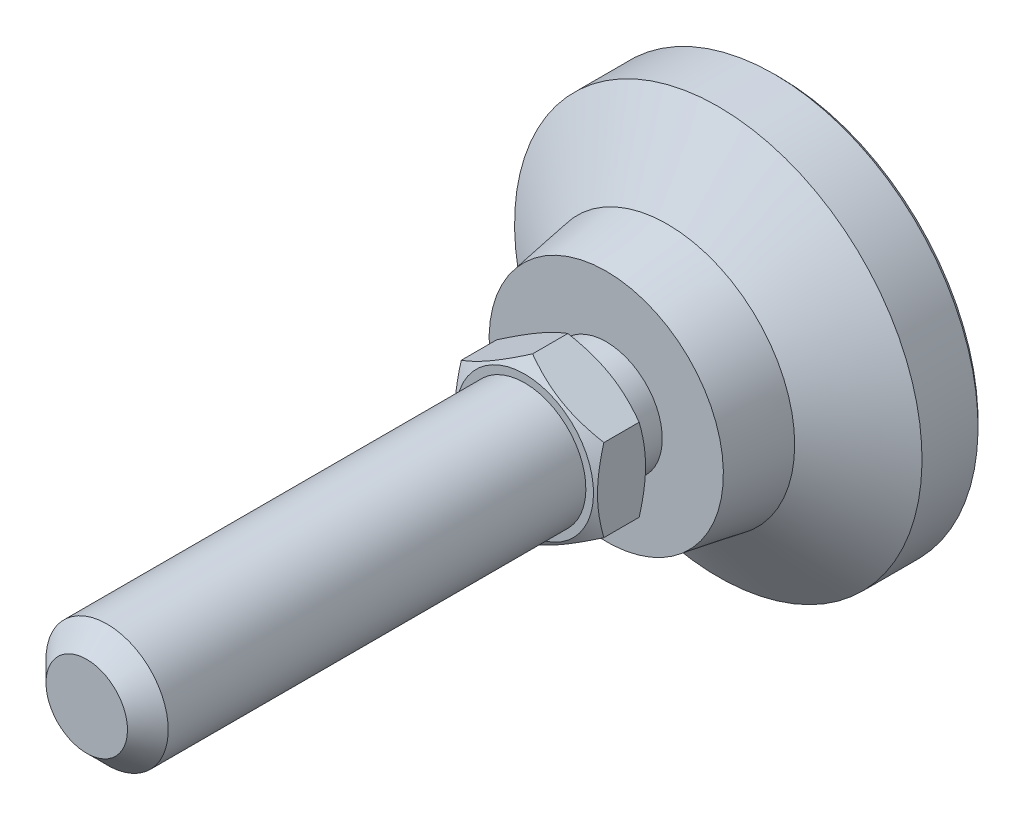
ISO-10303-21;
HEADER;
FILE_DESCRIPTION(('STEP AP214'),'2;1');
FILE_NAME('part.step','',(''),(''),'','','');
FILE_SCHEMA(('AUTOMOTIVE_DESIGN { 1 0 10303 214 1 1 1 1 }'));
ENDSEC;
DATA;
#1=APPLICATION_CONTEXT('core data for automotive mechanical design processes');
#2=APPLICATION_PROTOCOL_DEFINITION('international standard','automotive_design',2000,#1);
#3=PRODUCT_CONTEXT('',#1,'mechanical');
#4=PRODUCT('Part','Part','',(#3));
#5=PRODUCT_RELATED_PRODUCT_CATEGORY('part','',(#4));
#6=PRODUCT_DEFINITION_FORMATION('','',#4);
#7=PRODUCT_DEFINITION_CONTEXT('part definition',#1,'design');
#8=PRODUCT_DEFINITION('design','',#6,#7);
#9=PRODUCT_DEFINITION_SHAPE('','',#8);
#10=(LENGTH_UNIT() NAMED_UNIT(*) SI_UNIT(.MILLI.,.METRE.));
#11=(NAMED_UNIT(*) PLANE_ANGLE_UNIT() SI_UNIT($,.RADIAN.));
#12=(NAMED_UNIT(*) SI_UNIT($,.STERADIAN.) SOLID_ANGLE_UNIT());
#13=UNCERTAINTY_MEASURE_WITH_UNIT(LENGTH_MEASURE(1.E-05),#10,'distance_accuracy_value','');
#14=(GEOMETRIC_REPRESENTATION_CONTEXT(3) GLOBAL_UNCERTAINTY_ASSIGNED_CONTEXT((#13)) GLOBAL_UNIT_ASSIGNED_CONTEXT((#10,
#11,#12)) REPRESENTATION_CONTEXT('',''));
#15=CARTESIAN_POINT('',(0.,0.,0.));
#16=DIRECTION('',(0.,0.,1.));
#17=DIRECTION('',(1.,0.,0.));
#18=AXIS2_PLACEMENT_3D('',#15,#16,#17);
#19=CARTESIAN_POINT('',(-5.49999999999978,0.,20.));
#20=DIRECTION('',(0.,0.,1.));
#21=DIRECTION('',(0.,-1.,0.));
#22=AXIS2_PLACEMENT_3D('',#19,#20,#21);
#23=PLANE('',#22);
#24=CARTESIAN_POINT('',(0.,0.,20.));
#25=DIRECTION('',(0.,0.,-1.));
#26=DIRECTION('',(0.,1.,0.));
#27=AXIS2_PLACEMENT_3D('',#24,#25,#26);
#28=CIRCLE('',#27,5.49999999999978);
#29=CARTESIAN_POINT('',(0.,5.49999999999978,20.));
#30=VERTEX_POINT('',#29);
#31=EDGE_CURVE('E99',#30,#30,#28,.T.);
#32=ORIENTED_EDGE('',*,*,#31,.F.);
#33=EDGE_LOOP('',(#32));
#34=FACE_BOUND('',#33,.T.);
#35=CARTESIAN_POINT('',(0.,0.,20.));
#36=DIRECTION('',(0.,0.,-1.));
#37=DIRECTION('',(0.,1.,0.));
#38=AXIS2_PLACEMENT_3D('',#35,#36,#37);
#39=CIRCLE('',#38,6.75);
#40=CARTESIAN_POINT('',(0.,6.75,20.));
#41=VERTEX_POINT('',#40);
#42=EDGE_CURVE('E79',#41,#41,#39,.T.);
#43=ORIENTED_EDGE('',*,*,#42,.T.);
#44=EDGE_LOOP('',(#43));
#45=FACE_BOUND('',#44,.T.);
#46=ADVANCED_FACE('F14',(#34,#45),#23,.F.);
#47=CARTESIAN_POINT('',(0.,0.,-1.00000000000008));
#48=DIRECTION('',(0.,0.,-1.));
#49=DIRECTION('',(0.,1.,0.));
#50=AXIS2_PLACEMENT_3D('',#47,#48,#49);
#51=CYLINDRICAL_SURFACE('',#50,20.);
#52=CARTESIAN_POINT('',(0.,0.,0.500000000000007));
#53=DIRECTION('',(0.,0.,-1.));
#54=DIRECTION('',(0.,1.,0.));
#55=AXIS2_PLACEMENT_3D('',#52,#53,#54);
#56=CIRCLE('',#55,20.);
#57=CARTESIAN_POINT('',(0.,20.,0.500000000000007));
#58=VERTEX_POINT('',#57);
#59=EDGE_CURVE('E117',#58,#58,#56,.F.);
#60=ORIENTED_EDGE('',*,*,#59,.T.);
#61=EDGE_LOOP('',(#60));
#62=FACE_BOUND('',#61,.T.);
#63=CARTESIAN_POINT('',(0.,0.,6.));
#64=DIRECTION('',(0.,0.,-1.));
#65=DIRECTION('',(0.,1.,0.));
#66=AXIS2_PLACEMENT_3D('',#63,#64,#65);
#67=CIRCLE('',#66,20.);
#68=CARTESIAN_POINT('',(0.,20.,6.));
#69=VERTEX_POINT('',#68);
#70=EDGE_CURVE('E111',#69,#69,#67,.T.);
#71=ORIENTED_EDGE('',*,*,#70,.T.);
#72=EDGE_LOOP('',(#71));
#73=FACE_BOUND('',#72,.T.);
#74=ADVANCED_FACE('F240',(#62,#73),#51,.T.);
#75=CARTESIAN_POINT('',(0.,0.,11.));
#76=DIRECTION('',(0.,0.,-1.));
#77=DIRECTION('',(0.,1.,0.));
#78=AXIS2_PLACEMENT_3D('',#75,#76,#77);
#79=CONICAL_SURFACE('',#78,12.5,0.98279372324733);
#80=ORIENTED_EDGE('',*,*,#70,.F.);
#81=EDGE_LOOP('',(#80));
#82=FACE_BOUND('',#81,.T.);
#83=CARTESIAN_POINT('',(0.,0.,11.));
#84=DIRECTION('',(0.,0.,-1.));
#85=DIRECTION('',(0.,1.,0.));
#86=AXIS2_PLACEMENT_3D('',#83,#84,#85);
#87=CIRCLE('',#86,12.5);
#88=CARTESIAN_POINT('',(0.,12.5,11.));
#89=VERTEX_POINT('',#88);
#90=EDGE_CURVE('E108',#89,#89,#87,.T.);
#91=ORIENTED_EDGE('',*,*,#90,.T.);
#92=EDGE_LOOP('',(#91));
#93=FACE_BOUND('',#92,.T.);
#94=ADVANCED_FACE('F247',(#82,#93),#79,.T.);
#95=CARTESIAN_POINT('',(0.,0.,17.));
#96=DIRECTION('',(0.,0.,-1.));
#97=DIRECTION('',(0.,1.,0.));
#98=AXIS2_PLACEMENT_3D('',#95,#96,#97);
#99=CONICAL_SURFACE('',#98,11.5,0.165148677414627);
#100=ORIENTED_EDGE('',*,*,#90,.F.);
#101=EDGE_LOOP('',(#100));
#102=FACE_BOUND('',#101,.T.);
#103=CARTESIAN_POINT('',(0.,0.,17.));
#104=DIRECTION('',(0.,0.,-1.));
#105=DIRECTION('',(0.,1.,0.));
#106=AXIS2_PLACEMENT_3D('',#103,#104,#105);
#107=CIRCLE('',#106,11.5);
#108=CARTESIAN_POINT('',(0.,11.5,17.));
#109=VERTEX_POINT('',#108);
#110=EDGE_CURVE('E105',#109,#109,#107,.T.);
#111=ORIENTED_EDGE('',*,*,#110,.T.);
#112=EDGE_LOOP('',(#111));
#113=FACE_BOUND('',#112,.T.);
#114=ADVANCED_FACE('F259',(#102,#113),#99,.T.);
#115=CARTESIAN_POINT('',(-11.5,0.,17.));
#116=DIRECTION('',(0.,0.,-1.));
#117=DIRECTION('',(0.,1.,0.));
#118=AXIS2_PLACEMENT_3D('',#115,#116,#117);
#119=PLANE('',#118);
#120=ORIENTED_EDGE('',*,*,#110,.F.);
#121=EDGE_LOOP('',(#120));
#122=FACE_BOUND('',#121,.T.);
#123=CARTESIAN_POINT('',(0.,0.,17.));
#124=DIRECTION('',(0.,0.,-1.));
#125=DIRECTION('',(0.,1.,0.));
#126=AXIS2_PLACEMENT_3D('',#123,#124,#125);
#127=CIRCLE('',#126,5.49999999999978);
#128=CARTESIAN_POINT('',(0.,5.49999999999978,17.));
#129=VERTEX_POINT('',#128);
#130=EDGE_CURVE('E102',#129,#129,#127,.T.);
#131=ORIENTED_EDGE('',*,*,#130,.T.);
#132=EDGE_LOOP('',(#131));
#133=FACE_BOUND('',#132,.T.);
#134=ADVANCED_FACE('F255',(#122,#133),#119,.F.);
#135=CARTESIAN_POINT('',(0.,0.,-1.00000000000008));
#136=DIRECTION('',(0.,0.,-1.));
#137=DIRECTION('',(0.,1.,0.));
#138=AXIS2_PLACEMENT_3D('',#135,#136,#137);
#139=CYLINDRICAL_SURFACE('',#138,5.49999999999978);
#140=ORIENTED_EDGE('',*,*,#130,.F.);
#141=EDGE_LOOP('',(#140));
#142=FACE_BOUND('',#141,.T.);
#143=ORIENTED_EDGE('',*,*,#31,.T.);
#144=EDGE_LOOP('',(#143));
#145=FACE_BOUND('',#144,.T.);
#146=ADVANCED_FACE('F252',(#142,#145),#139,.T.);
#147=CARTESIAN_POINT('',(0.,0.,0.));
#148=DIRECTION('',(0.,0.,-1.));
#149=DIRECTION('',(0.,1.,0.));
#150=AXIS2_PLACEMENT_3D('',#147,#148,#149);
#151=PLANE('',#150);
#152=CARTESIAN_POINT('',(0.,0.,0.));
#153=DIRECTION('',(0.,0.,-1.));
#154=DIRECTION('',(0.,1.,0.));
#155=AXIS2_PLACEMENT_3D('',#152,#153,#154);
#156=CIRCLE('',#155,19.5);
#157=CARTESIAN_POINT('',(0.,19.5,0.));
#158=VERTEX_POINT('',#157);
#159=EDGE_CURVE('E114',#158,#158,#156,.T.);
#160=ORIENTED_EDGE('',*,*,#159,.T.);
#161=EDGE_LOOP('',(#160));
#162=FACE_BOUND('',#161,.T.);
#163=ADVANCED_FACE('F198',(#162),#151,.T.);
#164=CARTESIAN_POINT('',(0.,0.,0.));
#165=DIRECTION('',(0.,0.,1.));
#166=DIRECTION('',(0.,-1.,0.));
#167=AXIS2_PLACEMENT_3D('',#164,#165,#166);
#168=CONICAL_SURFACE('',#167,19.5,0.785398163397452);
#169=ORIENTED_EDGE('',*,*,#59,.F.);
#170=EDGE_LOOP('',(#169));
#171=FACE_BOUND('',#170,.T.);
#172=ORIENTED_EDGE('',*,*,#159,.F.);
#173=EDGE_LOOP('',(#172));
#174=FACE_BOUND('',#173,.T.);
#175=ADVANCED_FACE('F16',(#171,#174),#168,.T.);
#176=CARTESIAN_POINT('',(0.,0.,20.));
#177=DIRECTION('',(0.,0.,1.));
#178=DIRECTION('',(0.,-1.,0.));
#179=AXIS2_PLACEMENT_3D('',#176,#177,#178);
#180=CONICAL_SURFACE('',#179,6.75,1.0471975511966);
#181=CARTESIAN_POINT('',(-7.,10.8144715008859,23.5404657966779));
#182=CARTESIAN_POINT('',(-7.,10.5090787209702,23.3924897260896));
#183=CARTESIAN_POINT('',(-7.,10.2029804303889,23.2459445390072));
#184=CARTESIAN_POINT('',(-7.,9.58899746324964,22.9565215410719));
#185=CARTESIAN_POINT('',(-7.,9.28111251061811,22.8136443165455));
#186=CARTESIAN_POINT('',(-7.,8.66157461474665,22.531635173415));
#187=CARTESIAN_POINT('',(-7.,8.34991025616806,22.392528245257));
#188=CARTESIAN_POINT('',(-7.,7.72408817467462,22.1200627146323));
#189=CARTESIAN_POINT('',(-7.,7.40993057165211,21.9867038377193));
#190=CARTESIAN_POINT('',(-7.,6.76864499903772,21.7231530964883));
#191=CARTESIAN_POINT('',(-7.,6.44142073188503,21.5931942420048));
#192=CARTESIAN_POINT('',(-7.,5.78312944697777,21.3432128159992));
#193=CARTESIAN_POINT('',(-7.,5.45206200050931,21.2231913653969));
#194=CARTESIAN_POINT('',(-7.,4.78618678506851,20.996266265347));
#195=CARTESIAN_POINT('',(-7.,4.45138828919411,20.8893357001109));
#196=CARTESIAN_POINT('',(-7.,3.77700130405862,20.6920493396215));
#197=CARTESIAN_POINT('',(-7.,3.43741437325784,20.6016882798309));
#198=CARTESIAN_POINT('',(-7.,2.75507648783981,20.4423886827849));
#199=CARTESIAN_POINT('',(-7.,2.41235301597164,20.3733356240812));
#200=CARTESIAN_POINT('',(-7.,1.89518023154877,20.2887474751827));
#201=CARTESIAN_POINT('',(-7.,1.72226169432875,20.2637155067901));
#202=CARTESIAN_POINT('',(-7.,1.37557926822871,20.2204739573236));
#203=CARTESIAN_POINT('',(-7.,1.20181546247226,20.2022637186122));
#204=CARTESIAN_POINT('',(-7.,0.855927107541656,20.1732546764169));
#205=CARTESIAN_POINT('',(-7.,0.683810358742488,20.1623632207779));
#206=CARTESIAN_POINT('',(-7.,0.339270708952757,20.1478656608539));
#207=CARTESIAN_POINT('',(-7.,0.166847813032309,20.1442594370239));
#208=CARTESIAN_POINT('',(-7.,-0.177996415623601,20.1444182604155));
#209=CARTESIAN_POINT('',(-7.,-0.350417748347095,20.14818334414));
#210=CARTESIAN_POINT('',(-7.,-0.694949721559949,20.1629934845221));
#211=CARTESIAN_POINT('',(-7.,-0.867060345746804,20.1740389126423));
#212=CARTESIAN_POINT('',(-7.,-1.2819561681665,20.2092084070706));
#213=CARTESIAN_POINT('',(-7.,-1.52444879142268,20.2368567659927));
#214=CARTESIAN_POINT('',(-7.,-2.00759556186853,20.3050875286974));
#215=CARTESIAN_POINT('',(-7.,-2.24824944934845,20.3456717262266));
#216=CARTESIAN_POINT('',(-7.,-2.96719956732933,20.4846727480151));
#217=CARTESIAN_POINT('',(-7.,-3.44220801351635,20.6003115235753));
#218=CARTESIAN_POINT('',(-7.,-4.15241948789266,20.800352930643));
#219=CARTESIAN_POINT('',(-7.,-4.39131851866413,20.8723840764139));
#220=CARTESIAN_POINT('',(-7.,-4.86679538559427,21.0238064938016));
#221=CARTESIAN_POINT('',(-7.,-5.10337320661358,21.1031978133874));
#222=CARTESIAN_POINT('',(-7.,-5.57428443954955,21.268076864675));
#223=CARTESIAN_POINT('',(-7.,-5.80861858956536,21.3535625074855));
#224=CARTESIAN_POINT('',(-7.,-6.27535353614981,21.5296364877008));
#225=CARTESIAN_POINT('',(-7.,-6.5077543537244,21.6202247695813));
#226=CARTESIAN_POINT('',(-7.,-7.04947506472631,21.837142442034));
#227=CARTESIAN_POINT('',(-7.,-7.35811652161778,21.965162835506));
#228=CARTESIAN_POINT('',(-7.,-7.97283327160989,22.2272402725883));
#229=CARTESIAN_POINT('',(-7.,-8.27890841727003,22.361297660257));
#230=CARTESIAN_POINT('',(-7.,-8.88895576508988,22.6342555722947));
#231=CARTESIAN_POINT('',(-7.,-9.19292755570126,22.7731570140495));
#232=CARTESIAN_POINT('',(-7.,-9.79906683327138,23.054849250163));
#233=CARTESIAN_POINT('',(-7.,-10.1012342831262,23.1976401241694));
#234=CARTESIAN_POINT('',(-7.,-10.7043583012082,23.4865368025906));
#235=CARTESIAN_POINT('',(-7.,-11.005313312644,23.6326458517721));
#236=CARTESIAN_POINT('',(-7.,-11.6059395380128,23.9274816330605));
#237=CARTESIAN_POINT('',(-7.,-11.9056107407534,24.0762083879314));
#238=CARTESIAN_POINT('',(-7.,-12.8029256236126,24.5255910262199));
#239=CARTESIAN_POINT('',(-7.,-13.3989469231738,24.8294861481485));
#240=CARTESIAN_POINT('',(-7.,-14.539091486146,25.4182127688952));
#241=CARTESIAN_POINT('',(-7.,-15.0834635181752,25.70256461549));
#242=CARTESIAN_POINT('',(-7.,-16.1701795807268,26.2751583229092));
#243=CARTESIAN_POINT('',(-7.,-16.7125235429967,26.5634003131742));
#244=CARTESIAN_POINT('',(-7.,-17.7943258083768,27.142159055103));
#245=CARTESIAN_POINT('',(-7.,-18.3337879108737,27.4326687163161));
#246=CARTESIAN_POINT('',(-7.,-19.4114115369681,28.0160233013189));
#247=CARTESIAN_POINT('',(-7.,-19.9495731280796,28.3088681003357));
#248=CARTESIAN_POINT('',(-7.,-20.4872541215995,28.6025867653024));
#249=B_SPLINE_CURVE_WITH_KNOTS('',3,(#181,#182,#183,#184,#185,#186,#187,#188,#189,#190,#191,
#192,#193,#194,#195,#196,#197,#198,#199,#200,#201,#202,#203,#204,#205,#206,#207,#208,#209,#210,
#211,#212,#213,#214,#215,#216,#217,#218,#219,#220,#221,#222,#223,#224,#225,#226,#227,#228,#229,
#230,#231,#232,#233,#234,#235,#236,#237,#238,#239,#240,#241,#242,#243,#244,#245,#246,#247,#248),
.UNSPECIFIED.,.F.,.F.,(4,2,2,2,2,2,2,2,2,2,2,2,2,2,2,2,2,2,2,2,2,2,2,2,2,2,2,2,2,2,2,2,2,4),(0.,
1.01807697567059,2.03631569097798,3.06016797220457,4.08397131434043,5.14010612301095,
6.19635989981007,7.25040410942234,8.3041128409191,9.35205552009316,9.87610504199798,
10.4001040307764,10.9173377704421,11.4345630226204,11.9517908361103,12.4690450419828,
13.2008218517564,13.9327001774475,15.3972856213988,16.1457907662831,16.8943007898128,
17.6425554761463,18.390802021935,19.3931327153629,20.3955206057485,21.3980993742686,
22.4006986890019,23.4043246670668,24.4079593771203,26.4149744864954,28.2574483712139,
30.0999837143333,31.9381117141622,33.7761421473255),.UNSPECIFIED.);
#250=CARTESIAN_POINT('',(-7.,4.04145188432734,20.7695523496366));
#251=VERTEX_POINT('',#250);
#252=CARTESIAN_POINT('',(-7.,-4.04145188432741,20.7695523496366));
#253=VERTEX_POINT('',#252);
#254=EDGE_CURVE('E85',#251,#253,#249,.T.);
#255=ORIENTED_EDGE('',*,*,#254,.F.);
#256=CARTESIAN_POINT('',(0.000200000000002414,8.08301923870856,20.7696190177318));
#257=CARTESIAN_POINT('',(-0.153667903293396,7.99418356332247,20.7183374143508));
#258=CARTESIAN_POINT('',(-0.308109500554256,7.90501666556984,20.669383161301));
#259=CARTESIAN_POINT('',(-0.618246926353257,7.72595873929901,20.5767703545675));
#260=CARTESIAN_POINT('',(-0.773943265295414,7.63606741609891,20.5331140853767));
#261=CARTESIAN_POINT('',(-1.24352516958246,7.36495417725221,20.4109491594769));
#262=CARTESIAN_POINT('',(-1.5592643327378,7.18266208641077,20.3414631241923));
#263=CARTESIAN_POINT('',(-2.03176224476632,6.90986528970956,20.2599825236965));
#264=CARTESIAN_POINT('',(-2.18710922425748,6.82017566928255,20.2367710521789));
#265=CARTESIAN_POINT('',(-2.49850511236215,6.64039116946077,20.1978487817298));
#266=CARTESIAN_POINT('',(-2.6545539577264,6.550296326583,20.1821373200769));
#267=CARTESIAN_POINT('',(-2.96692267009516,6.36995016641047,20.1586154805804));
#268=CARTESIAN_POINT('',(-3.12324202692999,6.27969914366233,20.1507961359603));
#269=CARTESIAN_POINT('',(-3.43601650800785,6.09911871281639,20.1432178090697));
#270=CARTESIAN_POINT('',(-3.59247162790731,6.00878930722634,20.1434585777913));
#271=CARTESIAN_POINT('',(-4.02110687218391,5.76131663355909,20.1551972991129));
#272=CARTESIAN_POINT('',(-4.29314668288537,5.6042543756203,20.1749033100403));
#273=CARTESIAN_POINT('',(-4.83541944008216,5.29117305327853,20.2373910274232));
#274=CARTESIAN_POINT('',(-5.10565047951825,5.13515508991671,20.2801940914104));
#275=CARTESIAN_POINT('',(-5.64901454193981,4.82144370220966,20.3871892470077));
#276=CARTESIAN_POINT('',(-5.92207900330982,4.66378986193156,20.4518346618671));
#277=CARTESIAN_POINT('',(-6.46413578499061,4.3508332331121,20.5985536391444));
#278=CARTESIAN_POINT('',(-6.73313504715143,4.19552643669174,20.6805927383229));
#279=CARTESIAN_POINT('',(-7.0002,4.0413364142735,20.7696190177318));
#280=B_SPLINE_CURVE_WITH_KNOTS('',3,(#256,#257,#258,#259,#260,#261,#262,#263,#264,#265,#266,
#267,#268,#269,#270,#271,#272,#273,#274,#275,#276,#277,#278,#279),.UNSPECIFIED.,.F.,.F.,(4,2,2,
2,2,2,2,2,2,2,2,4),(0.,0.554727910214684,1.10969417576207,2.22193274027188,2.76443041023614,
3.30688013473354,3.84871284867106,4.39052882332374,5.33376515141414,6.27787517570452,
7.24292418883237,8.20607866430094),.UNSPECIFIED.);
#281=CARTESIAN_POINT('',(0.,8.08290376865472,20.7695523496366));
#282=VERTEX_POINT('',#281);
#283=EDGE_CURVE('E207',#282,#251,#280,.T.);
#284=ORIENTED_EDGE('',*,*,#283,.F.);
#285=CARTESIAN_POINT('',(7.0002,4.04133641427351,20.7696190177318));
#286=CARTESIAN_POINT('',(6.8463320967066,4.1301720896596,20.7183374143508));
#287=CARTESIAN_POINT('',(6.69189049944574,4.21933898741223,20.669383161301));
#288=CARTESIAN_POINT('',(6.38175307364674,4.39839691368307,20.5767703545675));
#289=CARTESIAN_POINT('',(6.22605673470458,4.48828823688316,20.5331140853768));
#290=CARTESIAN_POINT('',(5.75647483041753,4.75940147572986,20.4109491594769));
#291=CARTESIAN_POINT('',(5.4407356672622,4.9416935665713,20.3414631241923));
#292=CARTESIAN_POINT('',(4.96823775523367,5.21449036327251,20.2599825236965));
#293=CARTESIAN_POINT('',(4.81289077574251,5.30417998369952,20.2367710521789));
#294=CARTESIAN_POINT('',(4.50149488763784,5.4839644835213,20.1978487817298));
#295=CARTESIAN_POINT('',(4.34544604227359,5.57405932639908,20.1821373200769));
#296=CARTESIAN_POINT('',(4.03307732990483,5.7544054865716,20.1586154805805));
#297=CARTESIAN_POINT('',(3.87675797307,5.84465650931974,20.1507961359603));
#298=CARTESIAN_POINT('',(3.56398349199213,6.02523694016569,20.1432178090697));
#299=CARTESIAN_POINT('',(3.40752837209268,6.11556634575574,20.1434585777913));
#300=CARTESIAN_POINT('',(2.97889312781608,6.36303901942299,20.1551972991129));
#301=CARTESIAN_POINT('',(2.70685331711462,6.52010127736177,20.1749033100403));
#302=CARTESIAN_POINT('',(2.16458055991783,6.83318259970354,20.2373910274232));
#303=CARTESIAN_POINT('',(1.89434952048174,6.98920056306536,20.2801940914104));
#304=CARTESIAN_POINT('',(1.35098545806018,7.30291195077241,20.3871892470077));
#305=CARTESIAN_POINT('',(1.07792099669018,7.46056579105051,20.451834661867));
#306=CARTESIAN_POINT('',(0.535864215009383,7.77352241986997,20.5985536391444));
#307=CARTESIAN_POINT('',(0.26686495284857,7.92882921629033,20.6805927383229));
#308=CARTESIAN_POINT('',(-0.000199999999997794,8.08301923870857,20.7696190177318));
#309=B_SPLINE_CURVE_WITH_KNOTS('',3,(#285,#286,#287,#288,#289,#290,#291,#292,#293,#294,#295,
#296,#297,#298,#299,#300,#301,#302,#303,#304,#305,#306,#307,#308),.UNSPECIFIED.,.F.,.F.,(4,2,2,
2,2,2,2,2,2,2,2,4),(0.,0.554727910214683,1.10969417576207,2.22193274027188,2.76443041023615,
3.30688013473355,3.84871284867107,4.39052882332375,5.33376515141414,6.27787517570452,
7.24292418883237,8.20607866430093),.UNSPECIFIED.);
#310=CARTESIAN_POINT('',(7.,4.04145188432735,20.7695523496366));
#311=VERTEX_POINT('',#310);
#312=EDGE_CURVE('E214',#311,#282,#309,.T.);
#313=ORIENTED_EDGE('',*,*,#312,.F.);
#314=CARTESIAN_POINT('',(7.,10.8144715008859,23.5404657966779));
#315=CARTESIAN_POINT('',(7.,10.5090787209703,23.3924897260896));
#316=CARTESIAN_POINT('',(7.,10.2029804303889,23.2459445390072));
#317=CARTESIAN_POINT('',(7.,9.58899746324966,22.9565215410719));
#318=CARTESIAN_POINT('',(7.,9.28111251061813,22.8136443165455));
#319=CARTESIAN_POINT('',(7.,8.66157461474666,22.531635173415));
#320=CARTESIAN_POINT('',(7.,8.34991025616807,22.392528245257));
#321=CARTESIAN_POINT('',(7.,7.72408817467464,22.1200627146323));
#322=CARTESIAN_POINT('',(7.,7.40993057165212,21.9867038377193));
#323=CARTESIAN_POINT('',(7.,6.76864499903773,21.7231530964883));
#324=CARTESIAN_POINT('',(7.,6.44142073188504,21.5931942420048));
#325=CARTESIAN_POINT('',(7.,5.78312944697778,21.3432128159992));
#326=CARTESIAN_POINT('',(7.,5.45206200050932,21.2231913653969));
#327=CARTESIAN_POINT('',(7.,4.78618678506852,20.996266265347));
#328=CARTESIAN_POINT('',(7.,4.45138828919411,20.8893357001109));
#329=CARTESIAN_POINT('',(7.,3.77700130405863,20.6920493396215));
#330=CARTESIAN_POINT('',(7.,3.43741437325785,20.6016882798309));
#331=CARTESIAN_POINT('',(7.,2.75507648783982,20.4423886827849));
#332=CARTESIAN_POINT('',(7.,2.41235301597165,20.3733356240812));
#333=CARTESIAN_POINT('',(7.,1.89518023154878,20.2887474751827));
#334=CARTESIAN_POINT('',(7.,1.72226169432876,20.2637155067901));
#335=CARTESIAN_POINT('',(7.,1.37557926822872,20.2204739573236));
#336=CARTESIAN_POINT('',(7.,1.20181546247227,20.2022637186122));
#337=CARTESIAN_POINT('',(7.,0.855927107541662,20.1732546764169));
#338=CARTESIAN_POINT('',(7.,0.683810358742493,20.1623632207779));
#339=CARTESIAN_POINT('',(7.,0.339270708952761,20.1478656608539));
#340=CARTESIAN_POINT('',(7.,0.166847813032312,20.1442594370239));
#341=CARTESIAN_POINT('',(7.,-0.177996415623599,20.1444182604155));
#342=CARTESIAN_POINT('',(7.,-0.350417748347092,20.14818334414));
#343=CARTESIAN_POINT('',(7.,-0.694949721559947,20.1629934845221));
#344=CARTESIAN_POINT('',(7.,-0.867060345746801,20.1740389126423));
#345=CARTESIAN_POINT('',(7.,-1.2819561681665,20.2092084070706));
#346=CARTESIAN_POINT('',(7.,-1.52444879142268,20.2368567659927));
#347=CARTESIAN_POINT('',(7.,-2.00759556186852,20.3050875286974));
#348=CARTESIAN_POINT('',(7.,-2.24824944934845,20.3456717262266));
#349=CARTESIAN_POINT('',(7.,-2.96719956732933,20.4846727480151));
#350=CARTESIAN_POINT('',(7.,-3.44220801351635,20.6003115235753));
#351=CARTESIAN_POINT('',(7.,-4.15241948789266,20.800352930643));
#352=CARTESIAN_POINT('',(7.,-4.39131851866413,20.8723840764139));
#353=CARTESIAN_POINT('',(7.,-4.86679538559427,21.0238064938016));
#354=CARTESIAN_POINT('',(7.,-5.10337320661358,21.1031978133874));
#355=CARTESIAN_POINT('',(7.,-5.57428443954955,21.268076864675));
#356=CARTESIAN_POINT('',(7.,-5.80861858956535,21.3535625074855));
#357=CARTESIAN_POINT('',(7.,-6.27535353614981,21.5296364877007));
#358=CARTESIAN_POINT('',(7.,-6.5077543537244,21.6202247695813));
#359=CARTESIAN_POINT('',(7.,-7.04947506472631,21.837142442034));
#360=CARTESIAN_POINT('',(7.,-7.35811652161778,21.965162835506));
#361=CARTESIAN_POINT('',(7.,-7.97283327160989,22.2272402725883));
#362=CARTESIAN_POINT('',(7.,-8.27890841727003,22.361297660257));
#363=CARTESIAN_POINT('',(7.,-8.88895576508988,22.6342555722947));
#364=CARTESIAN_POINT('',(7.,-9.19292755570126,22.7731570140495));
#365=CARTESIAN_POINT('',(7.,-9.79906683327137,23.054849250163));
#366=CARTESIAN_POINT('',(7.,-10.1012342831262,23.1976401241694));
#367=CARTESIAN_POINT('',(7.,-10.7043583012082,23.4865368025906));
#368=CARTESIAN_POINT('',(7.,-11.005313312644,23.6326458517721));
#369=CARTESIAN_POINT('',(7.,-11.6059395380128,23.9274816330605));
#370=CARTESIAN_POINT('',(7.,-11.9056107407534,24.0762083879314));
#371=CARTESIAN_POINT('',(7.,-12.8029256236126,24.5255910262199));
#372=CARTESIAN_POINT('',(7.,-13.3989469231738,24.8294861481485));
#373=CARTESIAN_POINT('',(7.,-14.539091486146,25.4182127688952));
#374=CARTESIAN_POINT('',(7.,-15.0834635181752,25.70256461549));
#375=CARTESIAN_POINT('',(7.,-16.1701795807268,26.2751583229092));
#376=CARTESIAN_POINT('',(7.,-16.7125235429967,26.5634003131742));
#377=CARTESIAN_POINT('',(7.,-17.7943258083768,27.142159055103));
#378=CARTESIAN_POINT('',(7.,-18.3337879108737,27.4326687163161));
#379=CARTESIAN_POINT('',(7.,-19.4114115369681,28.0160233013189));
#380=CARTESIAN_POINT('',(7.,-19.9495731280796,28.3088681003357));
#381=CARTESIAN_POINT('',(7.,-20.4872541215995,28.6025867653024));
#382=B_SPLINE_CURVE_WITH_KNOTS('',3,(#314,#315,#316,#317,#318,#319,#320,#321,#322,#323,#324,
#325,#326,#327,#328,#329,#330,#331,#332,#333,#334,#335,#336,#337,#338,#339,#340,#341,#342,#343,
#344,#345,#346,#347,#348,#349,#350,#351,#352,#353,#354,#355,#356,#357,#358,#359,#360,#361,#362,
#363,#364,#365,#366,#367,#368,#369,#370,#371,#372,#373,#374,#375,#376,#377,#378,#379,#380,#381),
.UNSPECIFIED.,.F.,.F.,(4,2,2,2,2,2,2,2,2,2,2,2,2,2,2,2,2,2,2,2,2,2,2,2,2,2,2,2,2,2,2,2,2,4),(0.,
1.01807697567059,2.03631569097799,3.06016797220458,4.08397131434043,5.14010612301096,
6.19635989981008,7.25040410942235,8.30411284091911,9.35205552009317,9.87610504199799,
10.4001040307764,10.9173377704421,11.4345630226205,11.9517908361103,12.4690450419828,
13.2008218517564,13.9327001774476,15.3972856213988,16.1457907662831,16.8943007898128,
17.6425554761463,18.3908020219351,19.3931327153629,20.3955206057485,21.3980993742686,
22.4006986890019,23.4043246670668,24.4079593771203,26.4149744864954,28.2574483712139,
30.0999837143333,31.9381117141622,33.7761421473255),.UNSPECIFIED.);
#383=CARTESIAN_POINT('',(7.,-4.04145188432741,20.7695523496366));
#384=VERTEX_POINT('',#383);
#385=EDGE_CURVE('E35',#384,#311,#382,.F.);
#386=ORIENTED_EDGE('',*,*,#385,.F.);
#387=CARTESIAN_POINT('',(-0.000199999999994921,-8.08301923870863,20.7696190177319));
#388=CARTESIAN_POINT('',(0.153667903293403,-7.99418356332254,20.7183374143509));
#389=CARTESIAN_POINT('',(0.308109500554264,-7.90501666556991,20.669383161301));
#390=CARTESIAN_POINT('',(0.618246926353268,-7.72595873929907,20.5767703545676));
#391=CARTESIAN_POINT('',(0.773943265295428,-7.63606741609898,20.5331140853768));
#392=CARTESIAN_POINT('',(1.24352516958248,-7.36495417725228,20.4109491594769));
#393=CARTESIAN_POINT('',(1.55926433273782,-7.18266208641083,20.3414631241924));
#394=CARTESIAN_POINT('',(2.03176224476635,-6.90986528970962,20.2599825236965));
#395=CARTESIAN_POINT('',(2.18710922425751,-6.82017566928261,20.2367710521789));
#396=CARTESIAN_POINT('',(2.49850511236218,-6.64039116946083,20.1978487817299));
#397=CARTESIAN_POINT('',(2.65455395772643,-6.55029632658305,20.1821373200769));
#398=CARTESIAN_POINT('',(2.96692267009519,-6.36995016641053,20.1586154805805));
#399=CARTESIAN_POINT('',(3.12324202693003,-6.27969914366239,20.1507961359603));
#400=CARTESIAN_POINT('',(3.43601650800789,-6.09911871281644,20.1432178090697));
#401=CARTESIAN_POINT('',(3.59247162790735,-6.00878930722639,20.1434585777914));
#402=CARTESIAN_POINT('',(4.02110687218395,-5.76131663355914,20.1551972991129));
#403=CARTESIAN_POINT('',(4.2931466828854,-5.60425437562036,20.1749033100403));
#404=CARTESIAN_POINT('',(4.8354194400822,-5.29117305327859,20.2373910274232));
#405=CARTESIAN_POINT('',(5.10565047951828,-5.13515508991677,20.2801940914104));
#406=CARTESIAN_POINT('',(5.64901454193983,-4.82144370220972,20.3871892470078));
#407=CARTESIAN_POINT('',(5.92207900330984,-4.66378986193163,20.4518346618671));
#408=CARTESIAN_POINT('',(6.46413578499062,-4.35083323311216,20.5985536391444));
#409=CARTESIAN_POINT('',(6.73313504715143,-4.19552643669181,20.680592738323));
#410=CARTESIAN_POINT('',(7.0002,-4.04133641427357,20.7696190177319));
#411=B_SPLINE_CURVE_WITH_KNOTS('',3,(#387,#388,#389,#390,#391,#392,#393,#394,#395,#396,#397,
#398,#399,#400,#401,#402,#403,#404,#405,#406,#407,#408,#409,#410),.UNSPECIFIED.,.F.,.F.,(4,2,2,
2,2,2,2,2,2,2,2,4),(0.,0.554727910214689,1.10969417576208,2.2219327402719,2.76443041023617,
3.30688013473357,3.84871284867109,4.39052882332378,5.33376515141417,6.27787517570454,
7.24292418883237,8.20607866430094),.UNSPECIFIED.);
#412=CARTESIAN_POINT('',(0.,-8.08290376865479,20.7695523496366));
#413=VERTEX_POINT('',#412);
#414=EDGE_CURVE('E72',#413,#384,#411,.T.);
#415=ORIENTED_EDGE('',*,*,#414,.F.);
#416=CARTESIAN_POINT('',(-7.0002,-4.04133641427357,20.7696190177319));
#417=CARTESIAN_POINT('',(-6.8463320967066,-4.13017208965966,20.7183374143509));
#418=CARTESIAN_POINT('',(-6.69189049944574,-4.21933898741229,20.669383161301));
#419=CARTESIAN_POINT('',(-6.38175307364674,-4.39839691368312,20.5767703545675));
#420=CARTESIAN_POINT('',(-6.22605673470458,-4.48828823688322,20.5331140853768));
#421=CARTESIAN_POINT('',(-5.75647483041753,-4.75940147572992,20.4109491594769));
#422=CARTESIAN_POINT('',(-5.44073566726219,-4.94169356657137,20.3414631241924));
#423=CARTESIAN_POINT('',(-4.96823775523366,-5.21449036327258,20.2599825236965));
#424=CARTESIAN_POINT('',(-4.8128907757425,-5.30417998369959,20.2367710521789));
#425=CARTESIAN_POINT('',(-4.50149488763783,-5.48396448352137,20.1978487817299));
#426=CARTESIAN_POINT('',(-4.34544604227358,-5.57405932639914,20.1821373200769));
#427=CARTESIAN_POINT('',(-4.03307732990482,-5.75440548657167,20.1586154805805));
#428=CARTESIAN_POINT('',(-3.87675797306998,-5.84465650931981,20.1507961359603));
#429=CARTESIAN_POINT('',(-3.56398349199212,-6.02523694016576,20.1432178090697));
#430=CARTESIAN_POINT('',(-3.40752837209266,-6.11556634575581,20.1434585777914));
#431=CARTESIAN_POINT('',(-2.97889312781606,-6.36303901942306,20.1551972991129));
#432=CARTESIAN_POINT('',(-2.7068533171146,-6.52010127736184,20.1749033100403));
#433=CARTESIAN_POINT('',(-2.16458055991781,-6.83318259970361,20.2373910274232));
#434=CARTESIAN_POINT('',(-1.89434952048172,-6.98920056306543,20.2801940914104));
#435=CARTESIAN_POINT('',(-1.35098545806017,-7.30291195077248,20.3871892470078));
#436=CARTESIAN_POINT('',(-1.07792099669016,-7.46056579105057,20.4518346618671));
#437=CARTESIAN_POINT('',(-0.535864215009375,-7.77352241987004,20.5985536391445));
#438=CARTESIAN_POINT('',(-0.266864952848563,-7.9288292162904,20.680592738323));
#439=CARTESIAN_POINT('',(0.000200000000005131,-8.08301923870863,20.7696190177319));
#440=B_SPLINE_CURVE_WITH_KNOTS('',3,(#416,#417,#418,#419,#420,#421,#422,#423,#424,#425,#426,
#427,#428,#429,#430,#431,#432,#433,#434,#435,#436,#437,#438,#439),.UNSPECIFIED.,.F.,.F.,(4,2,2,
2,2,2,2,2,2,2,2,4),(0.,0.55472791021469,1.10969417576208,2.2219327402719,2.76443041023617,
3.30688013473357,3.84871284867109,4.39052882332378,5.33376515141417,6.27787517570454,
7.24292418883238,8.20607866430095),.UNSPECIFIED.);
#441=EDGE_CURVE('E75',#253,#413,#440,.T.);
#442=ORIENTED_EDGE('',*,*,#441,.F.);
#443=EDGE_LOOP('',(#255,#284,#313,#386,#415,#442));
#444=FACE_BOUND('',#443,.T.);
#445=ORIENTED_EDGE('',*,*,#42,.F.);
#446=EDGE_LOOP('',(#445));
#447=FACE_BOUND('',#446,.T.);
#448=ADVANCED_FACE('F73',(#444,#447),#180,.T.);
#449=CARTESIAN_POINT('',(-5.,18.4902968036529,68.));
#450=DIRECTION('',(0.,0.,-1.));
#451=DIRECTION('',(0.,1.,0.));
#452=AXIS2_PLACEMENT_3D('',#449,#450,#451);
#453=PLANE('',#452);
#454=CARTESIAN_POINT('',(0.,0.,68.));
#455=DIRECTION('',(0.,0.,-1.));
#456=DIRECTION('',(0.,1.,0.));
#457=AXIS2_PLACEMENT_3D('',#454,#455,#456);
#458=CIRCLE('',#457,3.99999999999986);
#459=CARTESIAN_POINT('',(0.,3.99999999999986,68.));
#460=VERTEX_POINT('',#459);
#461=EDGE_CURVE('E95',#460,#460,#458,.T.);
#462=ORIENTED_EDGE('',*,*,#461,.F.);
#463=EDGE_LOOP('',(#462));
#464=FACE_BOUND('',#463,.T.);
#465=ADVANCED_FACE('F164',(#464),#453,.F.);
#466=CARTESIAN_POINT('',(0.,0.,68.));
#467=DIRECTION('',(0.,0.,-1.));
#468=DIRECTION('',(0.,1.,0.));
#469=AXIS2_PLACEMENT_3D('',#466,#467,#468);
#470=CONICAL_SURFACE('',#469,4.,0.785398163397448);
#471=CARTESIAN_POINT('',(0.,0.,66.));
#472=DIRECTION('',(0.,0.,-1.));
#473=DIRECTION('',(0.,1.,0.));
#474=AXIS2_PLACEMENT_3D('',#471,#472,#473);
#475=CIRCLE('',#474,6.);
#476=CARTESIAN_POINT('',(0.,6.,66.));
#477=VERTEX_POINT('',#476);
#478=EDGE_CURVE('E90',#477,#477,#475,.T.);
#479=ORIENTED_EDGE('',*,*,#478,.F.);
#480=EDGE_LOOP('',(#479));
#481=FACE_BOUND('',#480,.T.);
#482=ORIENTED_EDGE('',*,*,#461,.T.);
#483=EDGE_LOOP('',(#482));
#484=FACE_BOUND('',#483,.T.);
#485=ADVANCED_FACE('F326',(#481,#484),#470,.T.);
#486=CARTESIAN_POINT('',(0.,0.,-7.74975615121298));
#487=DIRECTION('',(0.,0.,-1.));
#488=DIRECTION('',(0.,1.,0.));
#489=AXIS2_PLACEMENT_3D('',#486,#487,#488);
#490=CYLINDRICAL_SURFACE('',#489,6.);
#491=CARTESIAN_POINT('',(0.,0.,25.));
#492=DIRECTION('',(0.,0.,-1.));
#493=DIRECTION('',(0.,1.,0.));
#494=AXIS2_PLACEMENT_3D('',#491,#492,#493);
#495=CIRCLE('',#494,6.);
#496=CARTESIAN_POINT('',(0.,6.,25.));
#497=VERTEX_POINT('',#496);
#498=EDGE_CURVE('E28',#497,#497,#495,.F.);
#499=ORIENTED_EDGE('',*,*,#498,.T.);
#500=EDGE_LOOP('',(#499));
#501=FACE_BOUND('',#500,.T.);
#502=ORIENTED_EDGE('',*,*,#478,.T.);
#503=EDGE_LOOP('',(#502));
#504=FACE_BOUND('',#503,.T.);
#505=ADVANCED_FACE('F122',(#501,#504),#490,.T.);
#506=CARTESIAN_POINT('',(-3.99999999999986,0.,25.));
#507=DIRECTION('',(0.,0.,-1.));
#508=DIRECTION('',(0.,1.,0.));
#509=AXIS2_PLACEMENT_3D('',#506,#507,#508);
#510=PLANE('',#509);
#511=ORIENTED_EDGE('',*,*,#498,.F.);
#512=EDGE_LOOP('',(#511));
#513=FACE_BOUND('',#512,.T.);
#514=CARTESIAN_POINT('',(0.,0.,25.));
#515=DIRECTION('',(0.,0.,-1.));
#516=DIRECTION('',(0.,1.,0.));
#517=AXIS2_PLACEMENT_3D('',#514,#515,#516);
#518=CIRCLE('',#517,6.75);
#519=CARTESIAN_POINT('',(0.,6.75,25.));
#520=VERTEX_POINT('',#519);
#521=EDGE_CURVE('E84',#520,#520,#518,.T.);
#522=ORIENTED_EDGE('',*,*,#521,.F.);
#523=EDGE_LOOP('',(#522));
#524=FACE_BOUND('',#523,.T.);
#525=ADVANCED_FACE('F125',(#513,#524),#510,.F.);
#526=CARTESIAN_POINT('',(0.,0.,23.396505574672));
#527=DIRECTION('',(0.,0.,-1.));
#528=DIRECTION('',(0.,1.,0.));
#529=AXIS2_PLACEMENT_3D('',#526,#527,#528);
#530=CONICAL_SURFACE('',#529,9.52733381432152,1.0471975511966);
#531=CARTESIAN_POINT('',(7.0002,-4.04133641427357,24.230380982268));
#532=CARTESIAN_POINT('',(6.84633209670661,-4.13017208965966,24.281662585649));
#533=CARTESIAN_POINT('',(6.69189049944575,-4.21933898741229,24.3306168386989));
#534=CARTESIAN_POINT('',(6.38175307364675,-4.39839691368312,24.4232296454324));
#535=CARTESIAN_POINT('',(6.22605673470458,-4.48828823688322,24.4668859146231));
#536=CARTESIAN_POINT('',(5.75647483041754,-4.75940147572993,24.589050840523));
#537=CARTESIAN_POINT('',(5.4407356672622,-4.94169356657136,24.6585368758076));
#538=CARTESIAN_POINT('',(4.96823775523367,-5.21449036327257,24.7400174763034));
#539=CARTESIAN_POINT('',(4.81289077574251,-5.30417998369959,24.763228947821));
#540=CARTESIAN_POINT('',(4.50149488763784,-5.48396448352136,24.80215121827));
#541=CARTESIAN_POINT('',(4.34544604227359,-5.57405932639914,24.817862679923));
#542=CARTESIAN_POINT('',(4.03307732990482,-5.75440548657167,24.8413845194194));
#543=CARTESIAN_POINT('',(3.87675797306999,-5.84465650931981,24.8492038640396));
#544=CARTESIAN_POINT('',(3.56398349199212,-6.02523694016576,24.8567821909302));
#545=CARTESIAN_POINT('',(3.40752837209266,-6.11556634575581,24.8565414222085));
#546=CARTESIAN_POINT('',(2.97889312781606,-6.36303901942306,24.8448027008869));
#547=CARTESIAN_POINT('',(2.7068533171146,-6.52010127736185,24.8250966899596));
#548=CARTESIAN_POINT('',(2.1645805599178,-6.83318259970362,24.7626089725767));
#549=CARTESIAN_POINT('',(1.89434952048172,-6.98920056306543,24.7198059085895));
#550=CARTESIAN_POINT('',(1.35098545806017,-7.30291195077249,24.6128107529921));
#551=CARTESIAN_POINT('',(1.07792099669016,-7.46056579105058,24.5481653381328));
#552=CARTESIAN_POINT('',(0.535864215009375,-7.77352241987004,24.4014463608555));
#553=CARTESIAN_POINT('',(0.266864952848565,-7.9288292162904,24.3194072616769));
#554=CARTESIAN_POINT('',(-0.000199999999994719,-8.08301923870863,24.230380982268));
#555=B_SPLINE_CURVE_WITH_KNOTS('',3,(#531,#532,#533,#534,#535,#536,#537,#538,#539,#540,#541,
#542,#543,#544,#545,#546,#547,#548,#549,#550,#551,#552,#553,#554),.UNSPECIFIED.,.F.,.F.,(4,2,2,
2,2,2,2,2,2,2,2,4),(0.,0.554727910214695,1.10969417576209,2.2219327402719,2.76443041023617,
3.30688013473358,3.8487128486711,4.39052882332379,5.33376515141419,6.27787517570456,
7.2429241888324,8.20607866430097),.UNSPECIFIED.);
#556=CARTESIAN_POINT('',(7.,-4.04145188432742,24.2304476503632));
#557=VERTEX_POINT('',#556);
#558=CARTESIAN_POINT('',(0.,-8.08290376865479,24.2304476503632));
#559=VERTEX_POINT('',#558);
#560=EDGE_CURVE('E9',#557,#559,#555,.T.);
#561=ORIENTED_EDGE('',*,*,#560,.F.);
#562=CARTESIAN_POINT('',(7.,10.8144715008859,21.459534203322));
#563=CARTESIAN_POINT('',(7.,10.5090787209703,21.6075102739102));
#564=CARTESIAN_POINT('',(7.,10.202980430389,21.7540554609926));
#565=CARTESIAN_POINT('',(7.,9.58899746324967,22.043478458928));
#566=CARTESIAN_POINT('',(7.,9.28111251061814,22.1863556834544));
#567=CARTESIAN_POINT('',(7.,8.66157461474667,22.4683648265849));
#568=CARTESIAN_POINT('',(7.,8.34991025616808,22.6074717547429));
#569=CARTESIAN_POINT('',(7.,7.72408817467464,22.8799372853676));
#570=CARTESIAN_POINT('',(7.,7.40993057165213,23.0132961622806));
#571=CARTESIAN_POINT('',(7.,6.76864499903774,23.2768469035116));
#572=CARTESIAN_POINT('',(7.,6.44142073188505,23.4068057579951));
#573=CARTESIAN_POINT('',(7.,5.7831294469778,23.6567871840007));
#574=CARTESIAN_POINT('',(7.,5.45206200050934,23.776808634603));
#575=CARTESIAN_POINT('',(7.,4.78618678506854,24.0037337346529));
#576=CARTESIAN_POINT('',(7.,4.45138828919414,24.110664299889));
#577=CARTESIAN_POINT('',(7.,3.77700130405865,24.3079506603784));
#578=CARTESIAN_POINT('',(7.,3.43741437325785,24.398311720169));
#579=CARTESIAN_POINT('',(7.,2.75507648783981,24.5576113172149));
#580=CARTESIAN_POINT('',(7.,2.41235301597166,24.6266643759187));
#581=CARTESIAN_POINT('',(7.,1.89518023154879,24.7112525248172));
#582=CARTESIAN_POINT('',(7.,1.72226169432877,24.7362844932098));
#583=CARTESIAN_POINT('',(7.,1.37557926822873,24.7795260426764));
#584=CARTESIAN_POINT('',(7.,1.20181546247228,24.7977362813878));
#585=CARTESIAN_POINT('',(7.,0.855927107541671,24.826745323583));
#586=CARTESIAN_POINT('',(7.,0.683810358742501,24.8376367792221));
#587=CARTESIAN_POINT('',(7.,0.339270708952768,24.852134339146));
#588=CARTESIAN_POINT('',(7.,0.16684781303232,24.8557405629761));
#589=CARTESIAN_POINT('',(7.,-0.177996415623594,24.8555817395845));
#590=CARTESIAN_POINT('',(7.,-0.350417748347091,24.85181665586));
#591=CARTESIAN_POINT('',(7.,-0.694949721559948,24.8370065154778));
#592=CARTESIAN_POINT('',(7.,-0.8670603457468,24.8259610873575));
#593=CARTESIAN_POINT('',(7.,-1.28195616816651,24.7907915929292));
#594=CARTESIAN_POINT('',(7.,-1.5244487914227,24.7631432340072));
#595=CARTESIAN_POINT('',(7.,-2.00759556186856,24.6949124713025));
#596=CARTESIAN_POINT('',(7.,-2.24824944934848,24.6543282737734));
#597=CARTESIAN_POINT('',(7.,-2.96719956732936,24.5153272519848));
#598=CARTESIAN_POINT('',(7.,-3.44220801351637,24.3996884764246));
#599=CARTESIAN_POINT('',(7.,-4.15241948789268,24.1996470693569));
#600=CARTESIAN_POINT('',(7.,-4.39131851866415,24.127615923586));
#601=CARTESIAN_POINT('',(7.,-4.86679538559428,23.9761935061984));
#602=CARTESIAN_POINT('',(7.,-5.1033732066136,23.8968021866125));
#603=CARTESIAN_POINT('',(7.,-5.57428443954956,23.7319231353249));
#604=CARTESIAN_POINT('',(7.,-5.80861858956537,23.6464374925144));
#605=CARTESIAN_POINT('',(7.,-6.27535353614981,23.4703635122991));
#606=CARTESIAN_POINT('',(7.,-6.50775435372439,23.3797752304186));
#607=CARTESIAN_POINT('',(7.,-7.04947506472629,23.1628575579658));
#608=CARTESIAN_POINT('',(7.,-7.35811652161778,23.0348371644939));
#609=CARTESIAN_POINT('',(7.,-7.9728332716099,22.7727597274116));
#610=CARTESIAN_POINT('',(7.,-8.27890841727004,22.6387023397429));
#611=CARTESIAN_POINT('',(7.,-8.88895576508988,22.3657444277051));
#612=CARTESIAN_POINT('',(7.,-9.19292755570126,22.2268429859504));
#613=CARTESIAN_POINT('',(7.,-9.79906683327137,21.9451507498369));
#614=CARTESIAN_POINT('',(7.,-10.1012342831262,21.8023598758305));
#615=CARTESIAN_POINT('',(7.,-10.7043583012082,21.5134631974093));
#616=CARTESIAN_POINT('',(7.,-11.005313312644,21.3673541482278));
#617=CARTESIAN_POINT('',(7.,-11.6059395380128,21.0725183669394));
#618=CARTESIAN_POINT('',(7.,-11.9056107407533,20.9237916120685));
#619=CARTESIAN_POINT('',(7.,-12.8029256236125,20.47440897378));
#620=CARTESIAN_POINT('',(7.,-13.3989469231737,20.1705138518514));
#621=CARTESIAN_POINT('',(7.,-14.5390914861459,19.5817872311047));
#622=CARTESIAN_POINT('',(7.,-15.0834635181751,19.2974353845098));
#623=CARTESIAN_POINT('',(7.,-16.1701795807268,18.7248416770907));
#624=CARTESIAN_POINT('',(7.,-16.7125235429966,18.4365996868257));
#625=CARTESIAN_POINT('',(7.,-17.7943258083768,17.8578409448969));
#626=CARTESIAN_POINT('',(7.,-18.3337879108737,17.5673312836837));
#627=CARTESIAN_POINT('',(7.,-19.4114115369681,16.983976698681));
#628=CARTESIAN_POINT('',(7.,-19.9495731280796,16.6911318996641));
#629=CARTESIAN_POINT('',(7.,-20.4872541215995,16.3974132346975));
#630=B_SPLINE_CURVE_WITH_KNOTS('',3,(#562,#563,#564,#565,#566,#567,#568,#569,#570,#571,#572,
#573,#574,#575,#576,#577,#578,#579,#580,#581,#582,#583,#584,#585,#586,#587,#588,#589,#590,#591,
#592,#593,#594,#595,#596,#597,#598,#599,#600,#601,#602,#603,#604,#605,#606,#607,#608,#609,#610,
#611,#612,#613,#614,#615,#616,#617,#618,#619,#620,#621,#622,#623,#624,#625,#626,#627,#628,#629),
.UNSPECIFIED.,.F.,.F.,(4,2,2,2,2,2,2,2,2,2,2,2,2,2,2,2,2,2,2,2,2,2,2,2,2,2,2,2,2,2,2,2,2,4),(0.,
1.01807697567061,2.03631569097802,3.06016797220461,4.08397131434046,5.14010612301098,
6.1963598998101,7.25040410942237,8.30411284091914,9.35205552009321,9.87610504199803,
10.4001040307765,10.9173377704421,11.4345630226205,11.9517908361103,12.4690450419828,
13.2008218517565,13.9327001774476,15.3972856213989,16.1457907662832,16.8943007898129,
17.6425554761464,18.3908020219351,19.3931327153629,20.3955206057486,21.3980993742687,
22.4006986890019,23.4043246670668,24.4079593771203,26.4149744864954,28.257448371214,
30.0999837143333,31.9381117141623,33.7761421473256),.UNSPECIFIED.);
#631=CARTESIAN_POINT('',(7.,4.04145188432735,24.2304476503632));
#632=VERTEX_POINT('',#631);
#633=EDGE_CURVE('E133',#632,#557,#630,.T.);
#634=ORIENTED_EDGE('',*,*,#633,.F.);
#635=CARTESIAN_POINT('',(-0.000199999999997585,8.08301923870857,24.2303809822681));
#636=CARTESIAN_POINT('',(0.153667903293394,7.99418356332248,24.2816625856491));
#637=CARTESIAN_POINT('',(0.308109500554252,7.90501666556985,24.330616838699));
#638=CARTESIAN_POINT('',(0.618246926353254,7.72595873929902,24.4232296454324));
#639=CARTESIAN_POINT('',(0.773943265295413,7.63606741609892,24.4668859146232));
#640=CARTESIAN_POINT('',(1.24352516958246,7.36495417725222,24.589050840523));
#641=CARTESIAN_POINT('',(1.55926433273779,7.18266208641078,24.6585368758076));
#642=CARTESIAN_POINT('',(2.03176224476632,6.90986528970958,24.7400174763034));
#643=CARTESIAN_POINT('',(2.18710922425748,6.82017566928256,24.7632289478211));
#644=CARTESIAN_POINT('',(2.49850511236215,6.64039116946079,24.8021512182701));
#645=CARTESIAN_POINT('',(2.6545539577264,6.55029632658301,24.817862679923));
#646=CARTESIAN_POINT('',(2.96692267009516,6.36995016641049,24.8413845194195));
#647=CARTESIAN_POINT('',(3.12324202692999,6.27969914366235,24.8492038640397));
#648=CARTESIAN_POINT('',(3.43601650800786,6.0991187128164,24.8567821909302));
#649=CARTESIAN_POINT('',(3.59247162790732,6.00878930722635,24.8565414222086));
#650=CARTESIAN_POINT('',(4.02110687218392,5.7613166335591,24.8448027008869));
#651=CARTESIAN_POINT('',(4.29314668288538,5.60425437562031,24.8250966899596));
#652=CARTESIAN_POINT('',(4.83541944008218,5.29117305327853,24.7626089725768));
#653=CARTESIAN_POINT('',(5.10565047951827,5.13515508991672,24.7198059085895));
#654=CARTESIAN_POINT('',(5.64901454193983,4.82144370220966,24.6128107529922));
#655=CARTESIAN_POINT('',(5.92207900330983,4.66378986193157,24.5481653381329));
#656=CARTESIAN_POINT('',(6.46413578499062,4.3508332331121,24.4014463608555));
#657=CARTESIAN_POINT('',(6.73313504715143,4.19552643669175,24.319407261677));
#658=CARTESIAN_POINT('',(7.0002,4.04133641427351,24.2303809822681));
#659=B_SPLINE_CURVE_WITH_KNOTS('',3,(#635,#636,#637,#638,#639,#640,#641,#642,#643,#644,#645,
#646,#647,#648,#649,#650,#651,#652,#653,#654,#655,#656,#657,#658),.UNSPECIFIED.,.F.,.F.,(4,2,2,
2,2,2,2,2,2,2,2,4),(0.,0.554727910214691,1.10969417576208,2.22193274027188,2.76443041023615,
3.30688013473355,3.84871284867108,4.39052882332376,5.33376515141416,6.27787517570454,
7.24292418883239,8.20607866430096),.UNSPECIFIED.);
#660=CARTESIAN_POINT('',(0.,8.08290376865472,24.2304476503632));
#661=VERTEX_POINT('',#660);
#662=EDGE_CURVE('E136',#661,#632,#659,.T.);
#663=ORIENTED_EDGE('',*,*,#662,.F.);
#664=CARTESIAN_POINT('',(-7.0002,4.0413364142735,24.2303809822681));
#665=CARTESIAN_POINT('',(-6.84633209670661,4.13017208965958,24.2816625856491));
#666=CARTESIAN_POINT('',(-6.69189049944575,4.21933898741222,24.3306168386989));
#667=CARTESIAN_POINT('',(-6.38175307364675,4.39839691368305,24.4232296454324));
#668=CARTESIAN_POINT('',(-6.22605673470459,4.48828823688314,24.4668859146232));
#669=CARTESIAN_POINT('',(-5.75647483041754,4.75940147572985,24.589050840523));
#670=CARTESIAN_POINT('',(-5.44073566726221,4.94169356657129,24.6585368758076));
#671=CARTESIAN_POINT('',(-4.96823775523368,5.21449036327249,24.7400174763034));
#672=CARTESIAN_POINT('',(-4.81289077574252,5.30417998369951,24.7632289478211));
#673=CARTESIAN_POINT('',(-4.50149488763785,5.48396448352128,24.8021512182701));
#674=CARTESIAN_POINT('',(-4.3454460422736,5.57405932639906,24.817862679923));
#675=CARTESIAN_POINT('',(-4.03307732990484,5.75440548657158,24.8413845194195));
#676=CARTESIAN_POINT('',(-3.87675797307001,5.84465650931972,24.8492038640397));
#677=CARTESIAN_POINT('',(-3.56398349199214,6.02523694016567,24.8567821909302));
#678=CARTESIAN_POINT('',(-3.40752837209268,6.11556634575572,24.8565414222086));
#679=CARTESIAN_POINT('',(-2.97889312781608,6.36303901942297,24.8448027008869));
#680=CARTESIAN_POINT('',(-2.70685331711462,6.52010127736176,24.8250966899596));
#681=CARTESIAN_POINT('',(-2.16458055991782,6.83318259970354,24.7626089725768));
#682=CARTESIAN_POINT('',(-1.89434952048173,6.98920056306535,24.7198059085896));
#683=CARTESIAN_POINT('',(-1.35098545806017,7.30291195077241,24.6128107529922));
#684=CARTESIAN_POINT('',(-1.07792099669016,7.4605657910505,24.5481653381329));
#685=CARTESIAN_POINT('',(-0.535864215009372,7.77352241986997,24.4014463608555));
#686=CARTESIAN_POINT('',(-0.266864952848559,7.92882921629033,24.319407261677));
#687=CARTESIAN_POINT('',(0.000200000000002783,8.08301923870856,24.2303809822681));
#688=B_SPLINE_CURVE_WITH_KNOTS('',3,(#664,#665,#666,#667,#668,#669,#670,#671,#672,#673,#674,
#675,#676,#677,#678,#679,#680,#681,#682,#683,#684,#685,#686,#687),.UNSPECIFIED.,.F.,.F.,(4,2,2,
2,2,2,2,2,2,2,2,4),(0.,0.55472791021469,1.10969417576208,2.22193274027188,2.76443041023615,
3.30688013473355,3.84871284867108,4.39052882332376,5.33376515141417,6.27787517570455,
7.24292418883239,8.20607866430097),.UNSPECIFIED.);
#689=CARTESIAN_POINT('',(-7.,4.04145188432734,24.2304476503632));
#690=VERTEX_POINT('',#689);
#691=EDGE_CURVE('E172',#690,#661,#688,.T.);
#692=ORIENTED_EDGE('',*,*,#691,.F.);
#693=CARTESIAN_POINT('',(-7.,10.8144715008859,21.459534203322));
#694=CARTESIAN_POINT('',(-7.,10.5090787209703,21.6075102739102));
#695=CARTESIAN_POINT('',(-7.,10.202980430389,21.7540554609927));
#696=CARTESIAN_POINT('',(-7.,9.58899746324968,22.043478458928));
#697=CARTESIAN_POINT('',(-7.,9.28111251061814,22.1863556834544));
#698=CARTESIAN_POINT('',(-7.,8.66157461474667,22.4683648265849));
#699=CARTESIAN_POINT('',(-7.,8.34991025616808,22.6074717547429));
#700=CARTESIAN_POINT('',(-7.,7.72408817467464,22.8799372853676));
#701=CARTESIAN_POINT('',(-7.,7.40993057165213,23.0132961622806));
#702=CARTESIAN_POINT('',(-7.,6.76864499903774,23.2768469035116));
#703=CARTESIAN_POINT('',(-7.,6.44142073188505,23.4068057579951));
#704=CARTESIAN_POINT('',(-7.,5.7831294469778,23.6567871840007));
#705=CARTESIAN_POINT('',(-7.,5.45206200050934,23.776808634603));
#706=CARTESIAN_POINT('',(-7.,4.78618678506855,24.0037337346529));
#707=CARTESIAN_POINT('',(-7.,4.45138828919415,24.110664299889));
#708=CARTESIAN_POINT('',(-7.,3.77700130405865,24.3079506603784));
#709=CARTESIAN_POINT('',(-7.,3.43741437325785,24.398311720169));
#710=CARTESIAN_POINT('',(-7.,2.75507648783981,24.5576113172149));
#711=CARTESIAN_POINT('',(-7.,2.41235301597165,24.6266643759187));
#712=CARTESIAN_POINT('',(-7.,1.89518023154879,24.7112525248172));
#713=CARTESIAN_POINT('',(-7.,1.72226169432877,24.7362844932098));
#714=CARTESIAN_POINT('',(-7.,1.37557926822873,24.7795260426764));
#715=CARTESIAN_POINT('',(-7.,1.20181546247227,24.7977362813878));
#716=CARTESIAN_POINT('',(-7.,0.855927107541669,24.826745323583));
#717=CARTESIAN_POINT('',(-7.,0.683810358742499,24.8376367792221));
#718=CARTESIAN_POINT('',(-7.,0.339270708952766,24.852134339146));
#719=CARTESIAN_POINT('',(-7.,0.166847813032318,24.8557405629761));
#720=CARTESIAN_POINT('',(-7.,-0.177996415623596,24.8555817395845));
#721=CARTESIAN_POINT('',(-7.,-0.350417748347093,24.85181665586));
#722=CARTESIAN_POINT('',(-7.,-0.694949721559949,24.8370065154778));
#723=CARTESIAN_POINT('',(-7.,-0.867060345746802,24.8259610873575));
#724=CARTESIAN_POINT('',(-7.,-1.28195616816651,24.7907915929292));
#725=CARTESIAN_POINT('',(-7.,-1.5244487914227,24.7631432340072));
#726=CARTESIAN_POINT('',(-7.,-2.00759556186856,24.6949124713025));
#727=CARTESIAN_POINT('',(-7.,-2.24824944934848,24.6543282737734));
#728=CARTESIAN_POINT('',(-7.,-2.96719956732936,24.5153272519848));
#729=CARTESIAN_POINT('',(-7.,-3.44220801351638,24.3996884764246));
#730=CARTESIAN_POINT('',(-7.,-4.15241948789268,24.1996470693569));
#731=CARTESIAN_POINT('',(-7.,-4.39131851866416,24.127615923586));
#732=CARTESIAN_POINT('',(-7.,-4.86679538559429,23.9761935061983));
#733=CARTESIAN_POINT('',(-7.,-5.1033732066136,23.8968021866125));
#734=CARTESIAN_POINT('',(-7.,-5.57428443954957,23.7319231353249));
#735=CARTESIAN_POINT('',(-7.,-5.80861858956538,23.6464374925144));
#736=CARTESIAN_POINT('',(-7.,-6.27535353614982,23.4703635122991));
#737=CARTESIAN_POINT('',(-7.,-6.5077543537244,23.3797752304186));
#738=CARTESIAN_POINT('',(-7.,-7.0494750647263,23.1628575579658));
#739=CARTESIAN_POINT('',(-7.,-7.35811652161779,23.0348371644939));
#740=CARTESIAN_POINT('',(-7.,-7.97283327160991,22.7727597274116));
#741=CARTESIAN_POINT('',(-7.,-8.27890841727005,22.6387023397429));
#742=CARTESIAN_POINT('',(-7.,-8.88895576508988,22.3657444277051));
#743=CARTESIAN_POINT('',(-7.,-9.19292755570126,22.2268429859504));
#744=CARTESIAN_POINT('',(-7.,-9.79906683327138,21.9451507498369));
#745=CARTESIAN_POINT('',(-7.,-10.1012342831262,21.8023598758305));
#746=CARTESIAN_POINT('',(-7.,-10.7043583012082,21.5134631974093));
#747=CARTESIAN_POINT('',(-7.,-11.005313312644,21.3673541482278));
#748=CARTESIAN_POINT('',(-7.,-11.6059395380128,21.0725183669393));
#749=CARTESIAN_POINT('',(-7.,-11.9056107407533,20.9237916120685));
#750=CARTESIAN_POINT('',(-7.,-12.8029256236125,20.47440897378));
#751=CARTESIAN_POINT('',(-7.,-13.3989469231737,20.1705138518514));
#752=CARTESIAN_POINT('',(-7.,-14.5390914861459,19.5817872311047));
#753=CARTESIAN_POINT('',(-7.,-15.0834635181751,19.2974353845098));
#754=CARTESIAN_POINT('',(-7.,-16.1701795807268,18.7248416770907));
#755=CARTESIAN_POINT('',(-7.,-16.7125235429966,18.4365996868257));
#756=CARTESIAN_POINT('',(-7.,-17.7943258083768,17.8578409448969));
#757=CARTESIAN_POINT('',(-7.,-18.3337879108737,17.5673312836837));
#758=CARTESIAN_POINT('',(-7.,-19.4114115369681,16.983976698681));
#759=CARTESIAN_POINT('',(-7.,-19.9495731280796,16.6911318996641));
#760=CARTESIAN_POINT('',(-7.,-20.4872541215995,16.3974132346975));
#761=B_SPLINE_CURVE_WITH_KNOTS('',3,(#693,#694,#695,#696,#697,#698,#699,#700,#701,#702,#703,
#704,#705,#706,#707,#708,#709,#710,#711,#712,#713,#714,#715,#716,#717,#718,#719,#720,#721,#722,
#723,#724,#725,#726,#727,#728,#729,#730,#731,#732,#733,#734,#735,#736,#737,#738,#739,#740,#741,
#742,#743,#744,#745,#746,#747,#748,#749,#750,#751,#752,#753,#754,#755,#756,#757,#758,#759,#760),
.UNSPECIFIED.,.F.,.F.,(4,2,2,2,2,2,2,2,2,2,2,2,2,2,2,2,2,2,2,2,2,2,2,2,2,2,2,2,2,2,2,2,2,4),(0.,
1.01807697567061,2.03631569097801,3.06016797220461,4.08397131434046,5.14010612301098,
6.1963598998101,7.25040410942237,8.30411284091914,9.35205552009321,9.87610504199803,
10.4001040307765,10.9173377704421,11.4345630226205,11.9517908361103,12.4690450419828,
13.2008218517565,13.9327001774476,15.3972856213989,16.1457907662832,16.8943007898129,
17.6425554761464,18.3908020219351,19.3931327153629,20.3955206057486,21.3980993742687,
22.4006986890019,23.4043246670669,24.4079593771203,26.4149744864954,28.2574483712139,
30.0999837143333,31.9381117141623,33.7761421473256),.UNSPECIFIED.);
#762=CARTESIAN_POINT('',(-7.,-4.04145188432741,24.2304476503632));
#763=VERTEX_POINT('',#762);
#764=EDGE_CURVE('E179',#763,#690,#761,.F.);
#765=ORIENTED_EDGE('',*,*,#764,.F.);
#766=CARTESIAN_POINT('',(0.000200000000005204,-8.08301923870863,24.230380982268));
#767=CARTESIAN_POINT('',(-0.153667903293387,-7.99418356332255,24.281662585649));
#768=CARTESIAN_POINT('',(-0.308109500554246,-7.90501666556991,24.3306168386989));
#769=CARTESIAN_POINT('',(-0.618246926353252,-7.72595873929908,24.4232296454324));
#770=CARTESIAN_POINT('',(-0.773943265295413,-7.63606741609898,24.4668859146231));
#771=CARTESIAN_POINT('',(-1.24352516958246,-7.36495417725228,24.589050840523));
#772=CARTESIAN_POINT('',(-1.5592643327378,-7.18266208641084,24.6585368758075));
#773=CARTESIAN_POINT('',(-2.03176224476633,-6.90986528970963,24.7400174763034));
#774=CARTESIAN_POINT('',(-2.18710922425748,-6.82017566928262,24.763228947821));
#775=CARTESIAN_POINT('',(-2.49850511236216,-6.64039116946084,24.80215121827));
#776=CARTESIAN_POINT('',(-2.65455395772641,-6.55029632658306,24.817862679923));
#777=CARTESIAN_POINT('',(-2.96692267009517,-6.36995016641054,24.8413845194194));
#778=CARTESIAN_POINT('',(-3.12324202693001,-6.2796991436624,24.8492038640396));
#779=CARTESIAN_POINT('',(-3.43601650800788,-6.09911871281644,24.8567821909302));
#780=CARTESIAN_POINT('',(-3.59247162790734,-6.00878930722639,24.8565414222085));
#781=CARTESIAN_POINT('',(-4.02110687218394,-5.76131663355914,24.8448027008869));
#782=CARTESIAN_POINT('',(-4.2931466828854,-5.60425437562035,24.8250966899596));
#783=CARTESIAN_POINT('',(-4.8354194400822,-5.29117305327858,24.7626089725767));
#784=CARTESIAN_POINT('',(-5.10565047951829,-5.13515508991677,24.7198059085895));
#785=CARTESIAN_POINT('',(-5.64901454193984,-4.82144370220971,24.6128107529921));
#786=CARTESIAN_POINT('',(-5.92207900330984,-4.66378986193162,24.5481653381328));
#787=CARTESIAN_POINT('',(-6.46413578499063,-4.35083323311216,24.4014463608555));
#788=CARTESIAN_POINT('',(-6.73313504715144,-4.1955264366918,24.3194072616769));
#789=CARTESIAN_POINT('',(-7.0002,-4.04133641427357,24.230380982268));
#790=B_SPLINE_CURVE_WITH_KNOTS('',3,(#766,#767,#768,#769,#770,#771,#772,#773,#774,#775,#776,
#777,#778,#779,#780,#781,#782,#783,#784,#785,#786,#787,#788,#789),.UNSPECIFIED.,.F.,.F.,(4,2,2,
2,2,2,2,2,2,2,2,4),(0.,0.554727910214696,1.10969417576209,2.2219327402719,2.76443041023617,
3.30688013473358,3.84871284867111,4.3905288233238,5.33376515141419,6.27787517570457,
7.2429241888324,8.20607866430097),.UNSPECIFIED.);
#791=EDGE_CURVE('E186',#559,#763,#790,.T.);
#792=ORIENTED_EDGE('',*,*,#791,.F.);
#793=EDGE_LOOP('',(#561,#634,#663,#692,#765,#792));
#794=FACE_BOUND('',#793,.T.);
#795=ORIENTED_EDGE('',*,*,#521,.T.);
#796=EDGE_LOOP('',(#795));
#797=FACE_BOUND('',#796,.T.);
#798=ADVANCED_FACE('F128',(#794,#797),#530,.T.);
#799=CARTESIAN_POINT('',(0.,-8.08290376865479,20.));
#800=DIRECTION('',(0.5,-0.866025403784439,0.));
#801=DIRECTION('',(0.866025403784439,0.5,0.));
#802=AXIS2_PLACEMENT_3D('',#799,#800,#801);
#803=PLANE('',#802);
#804=DIRECTION('',(0.,0.,1.));
#805=VECTOR('',#804,1.);
#806=CARTESIAN_POINT('',(0.,-8.08290376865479,20.));
#807=LINE('',#806,#805);
#808=EDGE_CURVE('E43',#413,#559,#807,.T.);
#809=ORIENTED_EDGE('',*,*,#808,.F.);
#810=ORIENTED_EDGE('',*,*,#414,.T.);
#811=DIRECTION('',(0.,0.,1.));
#812=VECTOR('',#811,1.);
#813=CARTESIAN_POINT('',(7.,-4.04145188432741,20.));
#814=LINE('',#813,#812);
#815=EDGE_CURVE('E89',#384,#557,#814,.T.);
#816=ORIENTED_EDGE('',*,*,#815,.T.);
#817=ORIENTED_EDGE('',*,*,#560,.T.);
#818=EDGE_LOOP('',(#809,#810,#816,#817));
#819=FACE_BOUND('',#818,.T.);
#820=ADVANCED_FACE('F87',(#819),#803,.T.);
#821=CARTESIAN_POINT('',(7.,-4.04145188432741,20.));
#822=DIRECTION('',(1.,0.,0.));
#823=DIRECTION('',(0.,1.,0.));
#824=AXIS2_PLACEMENT_3D('',#821,#822,#823);
#825=PLANE('',#824);
#826=ORIENTED_EDGE('',*,*,#815,.F.);
#827=ORIENTED_EDGE('',*,*,#385,.T.);
#828=DIRECTION('',(0.,0.,1.));
#829=VECTOR('',#828,1.);
#830=CARTESIAN_POINT('',(7.,4.04145188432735,20.));
#831=LINE('',#830,#829);
#832=EDGE_CURVE('E92',#311,#632,#831,.T.);
#833=ORIENTED_EDGE('',*,*,#832,.T.);
#834=ORIENTED_EDGE('',*,*,#633,.T.);
#835=EDGE_LOOP('',(#826,#827,#833,#834));
#836=FACE_BOUND('',#835,.T.);
#837=ADVANCED_FACE('F157',(#836),#825,.T.);
#838=CARTESIAN_POINT('',(7.,4.04145188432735,20.));
#839=DIRECTION('',(0.5,0.866025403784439,0.));
#840=DIRECTION('',(-0.866025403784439,0.5,0.));
#841=AXIS2_PLACEMENT_3D('',#838,#839,#840);
#842=PLANE('',#841);
#843=ORIENTED_EDGE('',*,*,#832,.F.);
#844=ORIENTED_EDGE('',*,*,#312,.T.);
#845=DIRECTION('',(0.,0.,1.));
#846=VECTOR('',#845,1.);
#847=CARTESIAN_POINT('',(0.,8.08290376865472,20.));
#848=LINE('',#847,#846);
#849=EDGE_CURVE('E428',#282,#661,#848,.T.);
#850=ORIENTED_EDGE('',*,*,#849,.T.);
#851=ORIENTED_EDGE('',*,*,#662,.T.);
#852=EDGE_LOOP('',(#843,#844,#850,#851));
#853=FACE_BOUND('',#852,.T.);
#854=ADVANCED_FACE('F225',(#853),#842,.T.);
#855=CARTESIAN_POINT('',(0.,8.08290376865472,20.));
#856=DIRECTION('',(-0.5,0.866025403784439,0.));
#857=DIRECTION('',(-0.866025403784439,-0.5,0.));
#858=AXIS2_PLACEMENT_3D('',#855,#856,#857);
#859=PLANE('',#858);
#860=ORIENTED_EDGE('',*,*,#849,.F.);
#861=ORIENTED_EDGE('',*,*,#283,.T.);
#862=DIRECTION('',(0.,0.,1.));
#863=VECTOR('',#862,1.);
#864=CARTESIAN_POINT('',(-7.,4.04145188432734,20.));
#865=LINE('',#864,#863);
#866=EDGE_CURVE('E426',#251,#690,#865,.T.);
#867=ORIENTED_EDGE('',*,*,#866,.T.);
#868=ORIENTED_EDGE('',*,*,#691,.T.);
#869=EDGE_LOOP('',(#860,#861,#867,#868));
#870=FACE_BOUND('',#869,.T.);
#871=ADVANCED_FACE('F196',(#870),#859,.T.);
#872=CARTESIAN_POINT('',(-7.,4.04145188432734,20.));
#873=DIRECTION('',(-1.,0.,0.));
#874=DIRECTION('',(0.,-1.,0.));
#875=AXIS2_PLACEMENT_3D('',#872,#873,#874);
#876=PLANE('',#875);
#877=ORIENTED_EDGE('',*,*,#866,.F.);
#878=ORIENTED_EDGE('',*,*,#254,.T.);
#879=DIRECTION('',(0.,0.,1.));
#880=VECTOR('',#879,1.);
#881=CARTESIAN_POINT('',(-7.,-4.04145188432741,20.));
#882=LINE('',#881,#880);
#883=EDGE_CURVE('E83',#253,#763,#882,.T.);
#884=ORIENTED_EDGE('',*,*,#883,.T.);
#885=ORIENTED_EDGE('',*,*,#764,.T.);
#886=EDGE_LOOP('',(#877,#878,#884,#885));
#887=FACE_BOUND('',#886,.T.);
#888=ADVANCED_FACE('F192',(#887),#876,.T.);
#889=CARTESIAN_POINT('',(-7.,-4.04145188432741,20.));
#890=DIRECTION('',(-0.5,-0.866025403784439,0.));
#891=DIRECTION('',(0.866025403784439,-0.5,0.));
#892=AXIS2_PLACEMENT_3D('',#889,#890,#891);
#893=PLANE('',#892);
#894=ORIENTED_EDGE('',*,*,#883,.F.);
#895=ORIENTED_EDGE('',*,*,#441,.T.);
#896=ORIENTED_EDGE('',*,*,#808,.T.);
#897=ORIENTED_EDGE('',*,*,#791,.T.);
#898=EDGE_LOOP('',(#894,#895,#896,#897));
#899=FACE_BOUND('',#898,.T.);
#900=ADVANCED_FACE('F82',(#899),#893,.T.);
#901=CLOSED_SHELL('',(#46,#74,#94,#114,#134,#146,#163,#175,#448,#465,#485,#505,#525,#798,#820,
#837,#854,#871,#888,#900));
#902=MANIFOLD_SOLID_BREP('B1',#901);
#903=ADVANCED_BREP_SHAPE_REPRESENTATION('',(#18,#902),#14);
#904=SHAPE_DEFINITION_REPRESENTATION(#9,#903);
ENDSEC;
END-ISO-10303-21;
